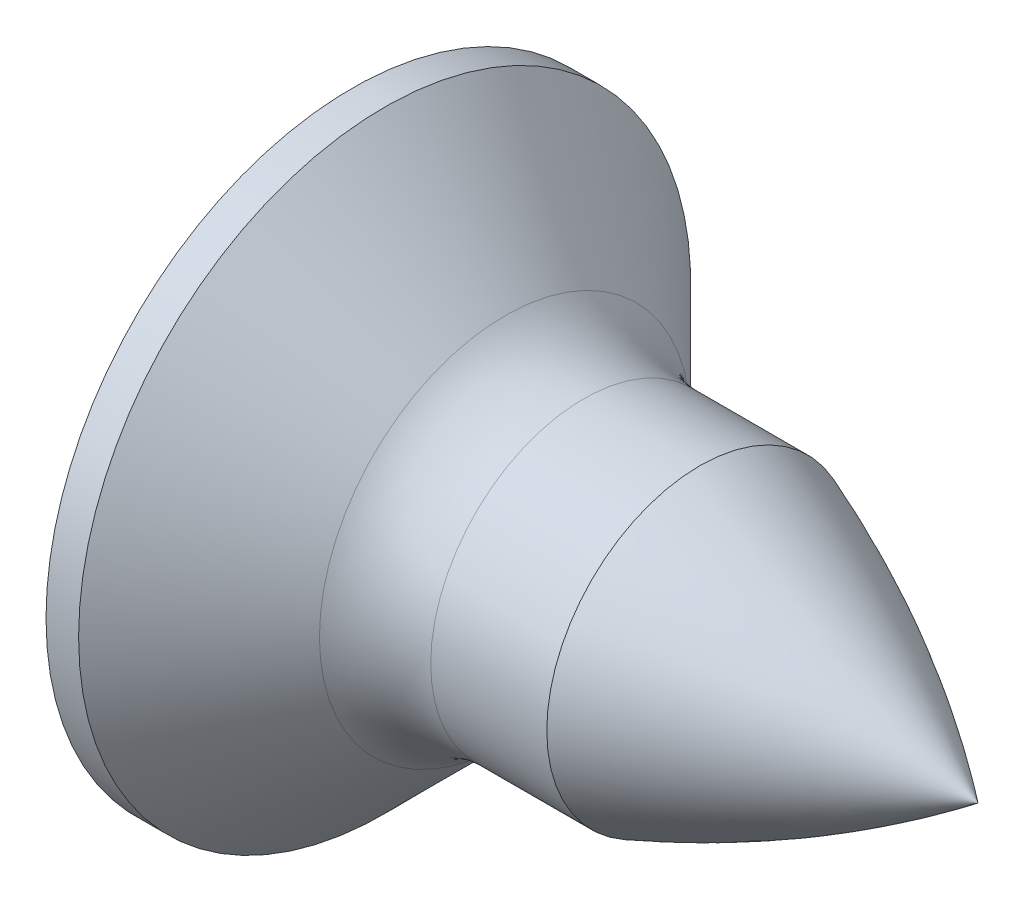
from build123d import *

# Parameters (mm, degrees)
CROSSRECESS_DEPTH = 1.2
DRAFT1_ANGLE      = -30


with BuildPart() as part:
    # Sketch1 → Base (revolve)
    with BuildSketch(Plane.XY, mode=Mode.PRIVATE) as base_sk:
        with BuildLine():
            Line((5, 0), (5, 1.1))
            Line((5, 1.1), (2.165685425, 1.1))
            ThreePointArc((2.165685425, 1.1), (1.859538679, 1.160896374), (1.6, 1.334314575))
            Line((1.6, 1.334314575), (0.734314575, 2.2))
            Line((0.734314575, 2.2), (0.5, 2.2))
            ThreePointArc((0.5, 2.2), (0.126573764, 1.128051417), (0, 0))
            Line((0, 0), (5, 0))
        make_face()
    revolve(base_sk.sketch.rotate(Axis((-20.418228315, 0, 0), (1, 0, 0)), 90), axis=Axis((-20.418228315, 0, 0), (1, 0, 0)))

    # Sketch2 → CrossRecess (cut)
    with BuildSketch(Plane(origin=(0, 0, 0), x_dir=(0, 0, -1), z_dir=(1, 0, 0))):
        Polygon((-0.22, 1.1), (0.22, 1.1), (0.22, 0.22), (1.1, 0.22), (1.1, -0.22), (0.22, -0.22), (0.22, -1.1), (-0.22, -1.1), (-0.22, -0.22), (-1.1, -0.22), (-1.1, 0.22), (-0.22, 0.22), align=None)
    extrude(amount=CROSSRECESS_DEPTH, mode=Mode.SUBTRACT)

    # Sketch5 → Cut-Revolve6 (revolve, cut)
    with BuildSketch(Plane.XY, mode=Mode.PRIVATE) as cut_revolve6_sk:
        with BuildLine():
            Line((5, 0), (5.5, 0))
            Line((5.5, 0), (5.5, -1.1))
            Line((5.5, -1.1), (5, -1.1))
            Line((5, -1.1), (3, -1.1))
            ThreePointArc((3, -1.1), (4.03943286, -0.621696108), (5, 0))
        make_face()
    revolve(cut_revolve6_sk.sketch.rotate(Axis((37.040663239, 0, 0), (-1, 0, 0)), 90), axis=Axis((37.040663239, 0, 0), (-1, 0, 0)), mode=Mode.SUBTRACT)

    # Draft1
    draft1_faces = [part.faces().sort_by_distance(p)[0] for p in [
        (0.660951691, -1.1, 0),
        (0.660951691, 0, -1.1),
        (0.660951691, 0, 1.1),
        (0.660951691, 1.1, 0),
    ]]
    draft(draft1_faces, Plane(origin=(0, 0, 0), x_dir=(0, 0, 1), z_dir=(1, 0, 0)), DRAFT1_ANGLE)


solid = part.part
